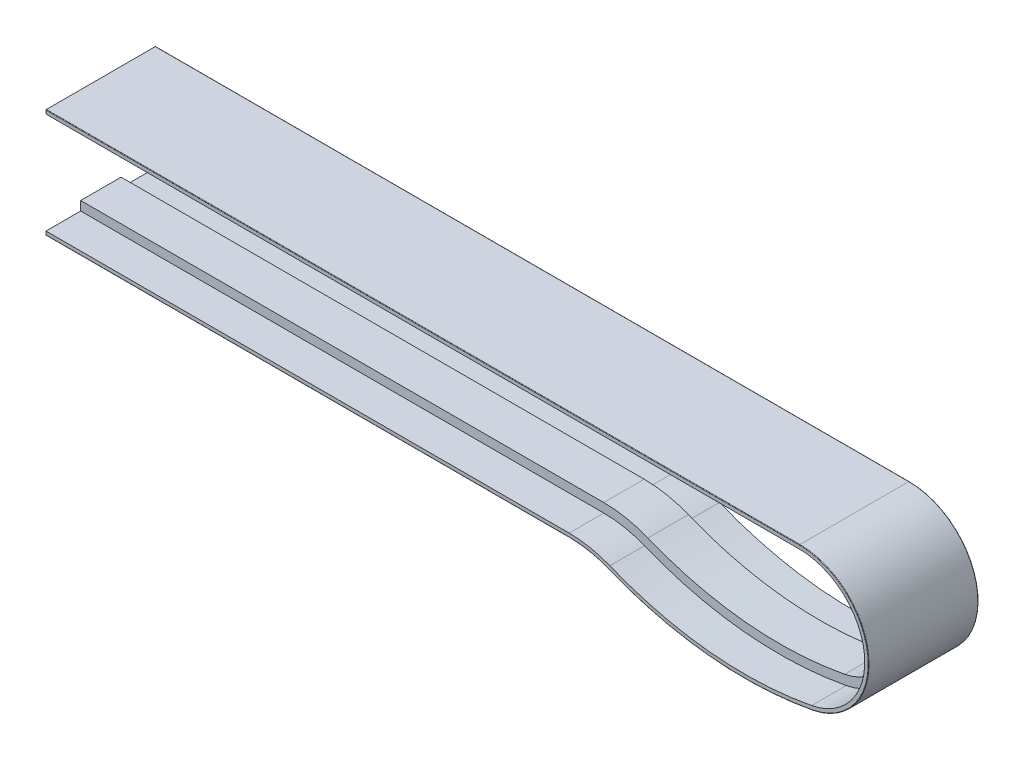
from build123d import *


with BuildPart() as part:
    # Balayage1: sweep along a path in Esquisse3
    with BuildLine(Plane(origin=(0, 0, 0), x_dir=(-1, 0, 0), z_dir=(0, 0, -1))) as balayage1_path:
        Line((0, 0), (-785, 0))
        ThreePointArc((-785, 0), (-856.684482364, -65.266873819), (-798.407240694, -142.740694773))
        ThreePointArc((-798.407240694, -142.740694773), (-690.619878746, -147.470305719), (-585.900068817, -121.504057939))
        ThreePointArc((-585.900068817, -121.504057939), (-565.837949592, -115.519814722), (-545, -113.5))
        Line((-545, -113.5), (0, -113.5))
    # Esquisse2 → Balayage1 (sweep)
    with BuildSketch(Plane(origin=(0, 0, 0), x_dir=(0, 0, -1), z_dir=(1, 0, 0))):
        with BuildLine():
            Line((-56.65, 0), (56.65, 0))
            ThreePointArc((56.65, 0), (57.003553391, -0.146446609), (57.15, -0.5))
            Line((57.15, -0.5), (57.15, -4))
            Line((57.15, -4), (21.05, -4))
            Line((21.05, -4), (21.05, -13.5))
            Line((21.05, -13.5), (-21.05, -13.5))
            Line((-21.05, -13.5), (-21.05, -4))
            Line((-21.05, -4), (-57.15, -4))
            Line((-57.15, -4), (-57.15, -0.5))
            ThreePointArc((-57.15, -0.5), (-57.003553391, -0.146446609), (-56.65, 0))
        make_face()
    sweep(path=balayage1_path.line)


solid = part.part
